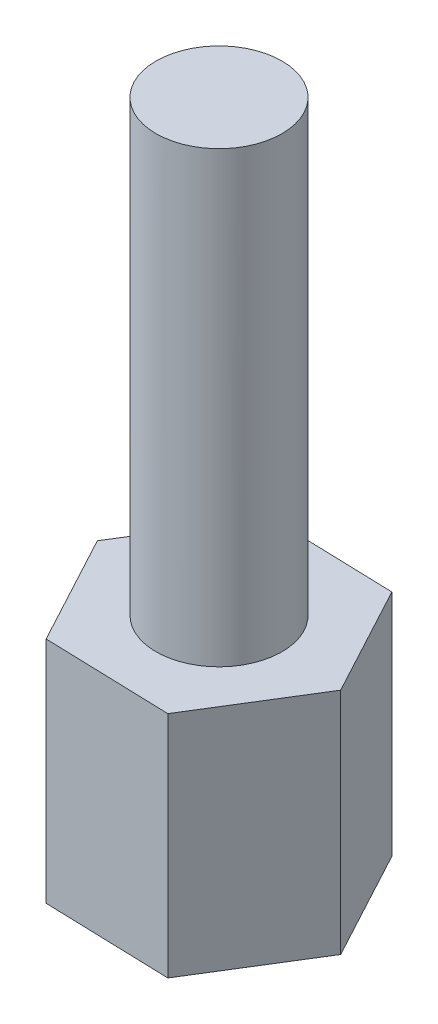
from build123d import *

# Parameters (mm, degrees)
EXTRUDE1_DEPTH     = 5
SKETCH2_R          = 1.375
EXTRUDE2_DEPTH     = 9.8
SKETCH3_R          = 1.36
CUT_EXTRUDE1_DEPTH = 4


with BuildPart() as part:
    # Sketch1 → Extrude1 (new body)
    with BuildSketch(Plane(origin=(0, 0, 0), x_dir=(1, 0, 0), z_dir=(0, 1, 0))):
        Polygon((1.298027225, -2.41577289), (2.741134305, -0.083761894), (1.44310708, 2.332010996), (-1.298027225, 2.41577289), (-2.741134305, 0.083761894), (-1.44310708, -2.332010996), align=None)
    extrude(amount=EXTRUDE1_DEPTH)

    # Sketch2 → Extrude2 (add)
    with BuildSketch(Plane(origin=(0, 5, 0), x_dir=(-1, 0, 0), z_dir=(0, 1, 0))):
        with Locations(Location((0, 0, 0), (0, 0, 270))):
            Circle(SKETCH2_R)
    extrude(amount=EXTRUDE2_DEPTH)

    # Sketch3 → Cut-Extrude1 (cut)
    with BuildSketch(Plane.XZ):
        with Locations(Location((0, 0, 0), (0, 0, 270))):
            Circle(SKETCH3_R)
    extrude(amount=-CUT_EXTRUDE1_DEPTH, mode=Mode.SUBTRACT)


solid = part.part
